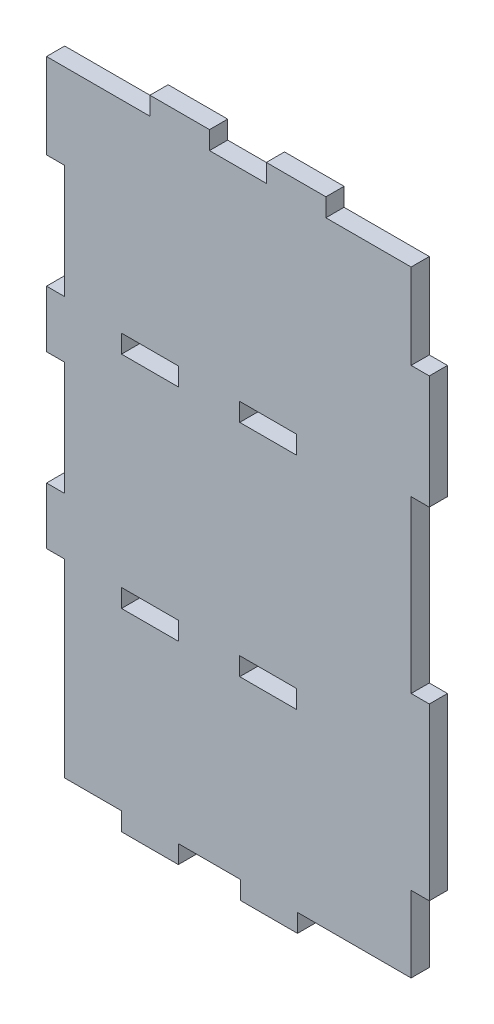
from build123d import *

# Parameters (mm, degrees)
SKETCH1_W           = 50
SKETCH1_H           = 16
BOSS_EXTRUDE1_DEPTH = 16


with BuildPart() as part:
    # Sketch1 → Boss-Extrude1 (new body)
    with BuildSketch(Plane.XY):
        Polygon((233.770918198, 646.8), (181.370918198, 646.8), (181.370918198, 630.8), (131.370918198, 630.8), (131.370918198, 646.8), (78.970918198, 646.8), (78.970918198, 630.8), (-12.029081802, 630.8), (-12.029081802, 555.8), (3.970918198, 555.8), (3.970918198, 455.8), (-12.029081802, 455.8), (-12.029081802, 405.8), (3.970918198, 405.8), (3.970918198, 305.8), (-12.029081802, 305.8), (-12.029081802, 255.8), (3.970918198, 255.8), (3.970918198, 89), (53.970918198, 89), (53.970918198, 73), (103.970918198, 73), (103.970918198, 89), (158.770918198, 89), (158.770918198, 73), (208.770918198, 73), (208.770918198, 89), (308.770918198, 89), (308.770918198, 155.8), (324.770918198, 155.8), (324.770918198, 305.8), (308.770918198, 305.8), (308.770918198, 455.8), (324.770918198, 455.8), (324.770918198, 555.8), (308.770918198, 555.8), (308.770918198, 630.8), (233.770918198, 630.8), align=None)
        with Locations((78.970918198, 251.2)):
            Rectangle(SKETCH1_W, SKETCH1_H, mode=Mode.SUBTRACT)
        with Locations((182.970918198, 251.2)):
            Rectangle(SKETCH1_W, SKETCH1_H, mode=Mode.SUBTRACT)
        with Locations((78.970918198, 445)):
            Rectangle(SKETCH1_W, SKETCH1_H, mode=Mode.SUBTRACT)
        with Locations((182.970918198, 445)):
            Rectangle(SKETCH1_W, SKETCH1_H, mode=Mode.SUBTRACT)
    extrude(amount=BOSS_EXTRUDE1_DEPTH)


solid = part.part
